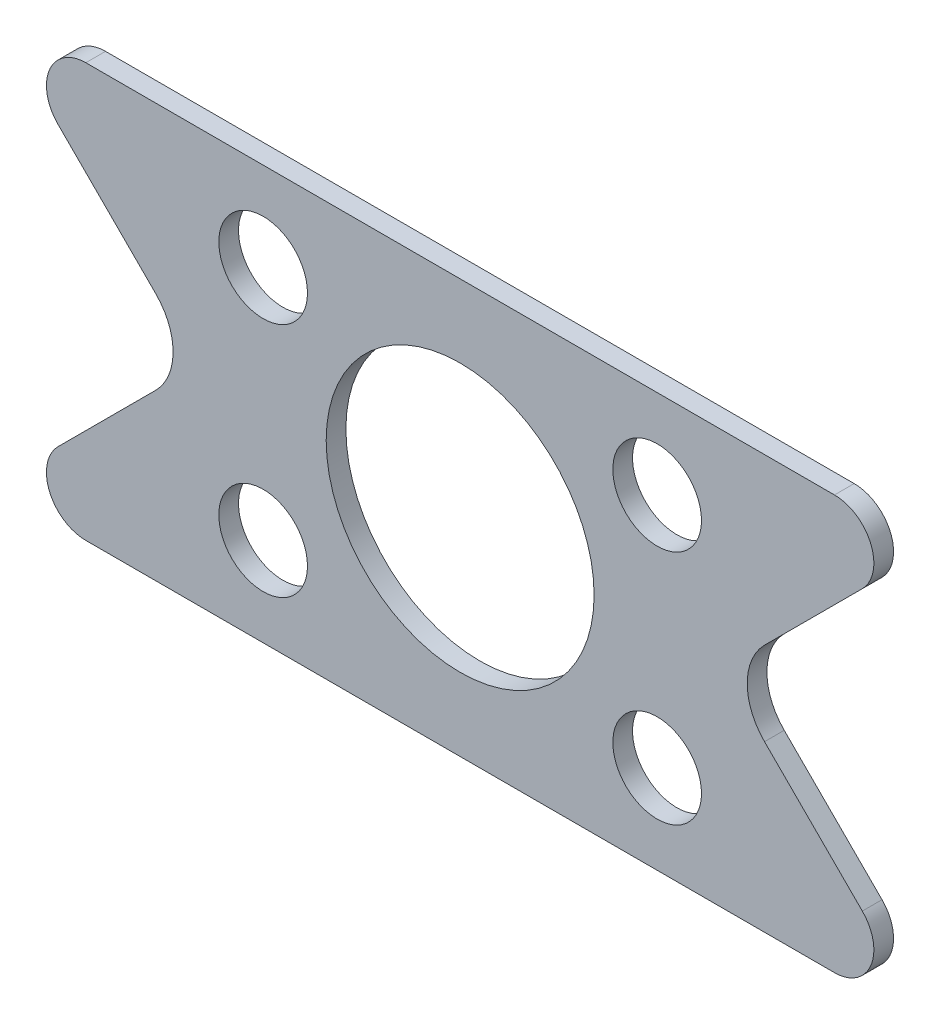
from build123d import *

# Parameters (mm, degrees)
ESQUISSE1_W             = 420
ESQUISSE1_H             = 210
ESQUISSE1_R             = 68
ESQUISSE1_R_2           = 22.5
EXTRUSION1_DEPTH        = 10
ENL_V_MAT_EXTRU_1_DEPTH = 10


with BuildPart() as part:
    # Esquisse1 → Extrusion1 (new body)
    with BuildSketch(Plane.XY):
        Rectangle(ESQUISSE1_W, ESQUISSE1_H)
        Circle(ESQUISSE1_R, mode=Mode.SUBTRACT)
        with Locations((100, 60)):
            Circle(ESQUISSE1_R_2, mode=Mode.SUBTRACT)
        with Locations((100, -60)):
            Circle(ESQUISSE1_R_2, mode=Mode.SUBTRACT)
        with Locations((-100, -60)):
            Circle(ESQUISSE1_R_2, mode=Mode.SUBTRACT)
        with Locations((-100, 60)):
            Circle(ESQUISSE1_R_2, mode=Mode.SUBTRACT)
    extrude(amount=EXTRUSION1_DEPTH)

    # Esquisse2 → Enl_v. mat.-Extru.1 (cut)
    with BuildSketch(Plane.XY.offset(10)):
        with BuildLine():
            Line((204.142135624, 70.857864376), (154.497474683, 21.213203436))
            ThreePointArc((154.497474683, 21.213203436), (145.710678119, 0), (154.497474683, -21.213203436))
            Line((154.497474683, -21.213203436), (204.142135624, -70.857864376))
            ThreePointArc((204.142135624, -70.857864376), (208.47759065, -92.653668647), (190, -105))
            Line((190, -105), (228.981001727, -105))
            Line((228.981001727, -105), (228.981001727, 105))
            Line((228.981001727, 105), (190, 105))
            ThreePointArc((190, 105), (208.47759065, 92.653668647), (204.142135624, 70.857864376))
        make_face()
    enl_v_mat_extru_1 = extrude(amount=-ENL_V_MAT_EXTRU_1_DEPTH, mode=Mode.SUBTRACT)

    # Sym_trie1: Enl_v. mat.-Extru.1 across plane
    add(enl_v_mat_extru_1.mirror(Plane(origin=(0, 0, 0), x_dir=(0, 0, 1), z_dir=(1, 0, 0))), mode=Mode.SUBTRACT)


solid = part.part
